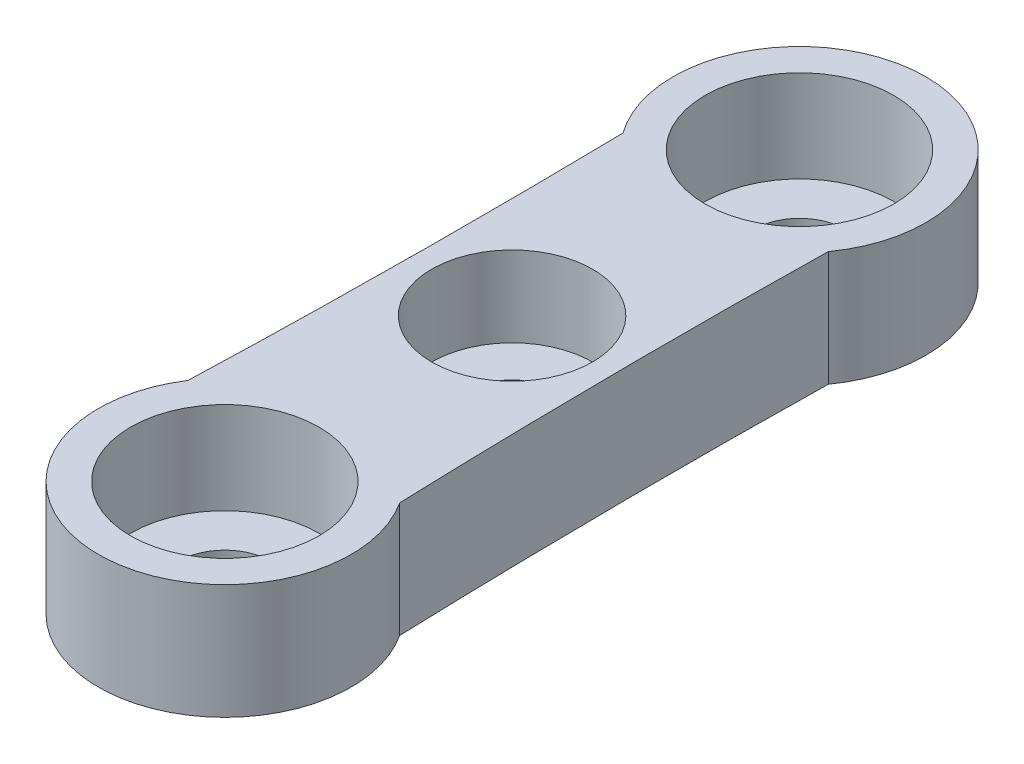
ISO-10303-21;
HEADER;
FILE_DESCRIPTION(('STEP AP214'),'2;1');
FILE_NAME('part.step','',(''),(''),'','','');
FILE_SCHEMA(('AUTOMOTIVE_DESIGN { 1 0 10303 214 1 1 1 1 }'));
ENDSEC;
DATA;
#1=APPLICATION_CONTEXT('core data for automotive mechanical design processes');
#2=APPLICATION_PROTOCOL_DEFINITION('international standard','automotive_design',2000,#1);
#3=PRODUCT_CONTEXT('',#1,'mechanical');
#4=PRODUCT('Part','Part','',(#3));
#5=PRODUCT_RELATED_PRODUCT_CATEGORY('part','',(#4));
#6=PRODUCT_DEFINITION_FORMATION('','',#4);
#7=PRODUCT_DEFINITION_CONTEXT('part definition',#1,'design');
#8=PRODUCT_DEFINITION('design','',#6,#7);
#9=PRODUCT_DEFINITION_SHAPE('','',#8);
#10=(LENGTH_UNIT() NAMED_UNIT(*) SI_UNIT(.MILLI.,.METRE.));
#11=(NAMED_UNIT(*) PLANE_ANGLE_UNIT() SI_UNIT($,.RADIAN.));
#12=(NAMED_UNIT(*) SI_UNIT($,.STERADIAN.) SOLID_ANGLE_UNIT());
#13=UNCERTAINTY_MEASURE_WITH_UNIT(LENGTH_MEASURE(1.E-05),#10,'distance_accuracy_value','');
#14=(GEOMETRIC_REPRESENTATION_CONTEXT(3) GLOBAL_UNCERTAINTY_ASSIGNED_CONTEXT((#13)) GLOBAL_UNIT_ASSIGNED_CONTEXT((#10,
#11,#12)) REPRESENTATION_CONTEXT('',''));
#15=CARTESIAN_POINT('',(0.,0.,0.));
#16=DIRECTION('',(0.,0.,1.));
#17=DIRECTION('',(1.,0.,0.));
#18=AXIS2_PLACEMENT_3D('',#15,#16,#17);
#19=CARTESIAN_POINT('',(0.,10.,0.));
#20=DIRECTION('',(0.,-1.,0.));
#21=DIRECTION('',(0.,0.,-1.));
#22=AXIS2_PLACEMENT_3D('',#19,#20,#21);
#23=CYLINDRICAL_SURFACE('',#22,1.525);
#24=CARTESIAN_POINT('',(0.,0.,0.));
#25=DIRECTION('',(0.,-1.,0.));
#26=DIRECTION('',(0.,0.,-1.));
#27=AXIS2_PLACEMENT_3D('',#24,#25,#26);
#28=CIRCLE('',#27,1.525);
#29=CARTESIAN_POINT('',(0.,0.,-1.525));
#30=VERTEX_POINT('',#29);
#31=EDGE_CURVE('E221',#30,#30,#28,.T.);
#32=ORIENTED_EDGE('',*,*,#31,.T.);
#33=EDGE_LOOP('',(#32));
#34=FACE_BOUND('',#33,.T.);
#35=CARTESIAN_POINT('',(0.,1.5,0.));
#36=DIRECTION('',(0.,1.,0.));
#37=DIRECTION('',(0.,0.,1.));
#38=AXIS2_PLACEMENT_3D('',#35,#36,#37);
#39=CIRCLE('',#38,1.525);
#40=CARTESIAN_POINT('',(0.,1.5,1.525));
#41=VERTEX_POINT('',#40);
#42=EDGE_CURVE('E42',#41,#41,#39,.F.);
#43=ORIENTED_EDGE('',*,*,#42,.F.);
#44=EDGE_LOOP('',(#43));
#45=FACE_BOUND('',#44,.T.);
#46=ADVANCED_FACE('F37',(#34,#45),#23,.F.);
#47=CARTESIAN_POINT('',(4.46618649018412,5.,-9.29014358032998));
#48=CARTESIAN_POINT('',(4.29282361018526,5.,0.105600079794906));
#49=CARTESIAN_POINT('',(4.60828596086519,5.,9.49771745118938));
#50=B_SPLINE_CURVE_WITH_KNOTS('',2,(#47,#48,#49),.UNSPECIFIED.,.F.,.F.,(3,3),(0.,1.),.UNSPECIFIED.);
#51=DIRECTION('',(0.,-1.,0.));
#52=VECTOR('',#51,1.);
#53=SURFACE_OF_LINEAR_EXTRUSION('',#50,#52);
#54=CARTESIAN_POINT('',(4.46618649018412,0.,-9.29014358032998));
#55=CARTESIAN_POINT('',(4.29282361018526,0.,0.105600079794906));
#56=CARTESIAN_POINT('',(4.60828596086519,0.,9.49771745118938));
#57=B_SPLINE_CURVE_WITH_KNOTS('',2,(#54,#55,#56),.UNSPECIFIED.,.F.,.F.,(3,3),(0.,1.),.UNSPECIFIED.);
#58=CARTESIAN_POINT('',(4.46618649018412,0.,-9.29014358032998));
#59=VERTEX_POINT('',#58);
#60=CARTESIAN_POINT('',(4.60828596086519,0.,9.49771745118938));
#61=VERTEX_POINT('',#60);
#62=EDGE_CURVE('E175',#59,#61,#57,.T.);
#63=ORIENTED_EDGE('',*,*,#62,.F.);
#64=DIRECTION('',(0.,-1.,0.));
#65=VECTOR('',#64,1.);
#66=CARTESIAN_POINT('',(4.46618649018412,5.,-9.29014358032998));
#67=LINE('',#66,#65);
#68=CARTESIAN_POINT('',(4.46618649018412,5.,-9.29014358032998));
#69=VERTEX_POINT('',#68);
#70=EDGE_CURVE('E84',#69,#59,#67,.T.);
#71=ORIENTED_EDGE('',*,*,#70,.F.);
#72=CARTESIAN_POINT('',(4.60828596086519,5.,9.49771745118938));
#73=VERTEX_POINT('',#72);
#74=EDGE_CURVE('E93',#69,#73,#50,.T.);
#75=ORIENTED_EDGE('',*,*,#74,.T.);
#76=DIRECTION('',(0.,-1.,0.));
#77=VECTOR('',#76,1.);
#78=CARTESIAN_POINT('',(4.60828596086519,5.,9.49771745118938));
#79=LINE('',#78,#77);
#80=EDGE_CURVE('E80',#73,#61,#79,.T.);
#81=ORIENTED_EDGE('',*,*,#80,.T.);
#82=EDGE_LOOP('',(#63,#71,#75,#81));
#83=FACE_BOUND('',#82,.T.);
#84=ADVANCED_FACE('F39',(#83),#53,.T.);
#85=CARTESIAN_POINT('',(0.,5.,-12.5));
#86=DIRECTION('',(0.,-1.,0.));
#87=DIRECTION('',(0.,0.,-1.));
#88=AXIS2_PLACEMENT_3D('',#85,#86,#87);
#89=CYLINDRICAL_SURFACE('',#88,5.5);
#90=CARTESIAN_POINT('',(0.,0.,-12.5));
#91=DIRECTION('',(0.,1.,0.));
#92=DIRECTION('',(0.,0.,1.));
#93=AXIS2_PLACEMENT_3D('',#90,#91,#92);
#94=CIRCLE('',#93,5.5);
#95=CARTESIAN_POINT('',(-4.46618649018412,0.,-9.29014358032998));
#96=VERTEX_POINT('',#95);
#97=EDGE_CURVE('E99',#59,#96,#94,.T.);
#98=ORIENTED_EDGE('',*,*,#97,.T.);
#99=DIRECTION('',(0.,-1.,0.));
#100=VECTOR('',#99,1.);
#101=CARTESIAN_POINT('',(-4.46618649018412,5.,-9.29014358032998));
#102=LINE('',#101,#100);
#103=CARTESIAN_POINT('',(-4.46618649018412,5.,-9.29014358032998));
#104=VERTEX_POINT('',#103);
#105=EDGE_CURVE('E96',#104,#96,#102,.T.);
#106=ORIENTED_EDGE('',*,*,#105,.F.);
#107=CARTESIAN_POINT('',(0.,5.,-12.5));
#108=DIRECTION('',(0.,1.,0.));
#109=DIRECTION('',(0.,0.,1.));
#110=AXIS2_PLACEMENT_3D('',#107,#108,#109);
#111=CIRCLE('',#110,5.5);
#112=EDGE_CURVE('E87',#69,#104,#111,.T.);
#113=ORIENTED_EDGE('',*,*,#112,.F.);
#114=ORIENTED_EDGE('',*,*,#70,.T.);
#115=EDGE_LOOP('',(#98,#106,#113,#114));
#116=FACE_BOUND('',#115,.T.);
#117=ADVANCED_FACE('F97',(#116),#89,.T.);
#118=CARTESIAN_POINT('',(-4.46618649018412,5.,-9.29014358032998));
#119=CARTESIAN_POINT('',(-4.29282361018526,5.,0.105600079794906));
#120=CARTESIAN_POINT('',(-4.60828596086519,5.,9.49771745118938));
#121=B_SPLINE_CURVE_WITH_KNOTS('',2,(#118,#119,#120),.UNSPECIFIED.,.F.,.F.,(3,3),(0.,1.),.UNSPECIFIED.);
#122=DIRECTION('',(0.,-1.,0.));
#123=VECTOR('',#122,1.);
#124=SURFACE_OF_LINEAR_EXTRUSION('',#121,#123);
#125=CARTESIAN_POINT('',(-4.46618649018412,0.,-9.29014358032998));
#126=CARTESIAN_POINT('',(-4.29282361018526,0.,0.105600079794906));
#127=CARTESIAN_POINT('',(-4.60828596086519,0.,9.49771745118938));
#128=B_SPLINE_CURVE_WITH_KNOTS('',2,(#125,#126,#127),.UNSPECIFIED.,.F.,.F.,(3,3),(0.,1.),.UNSPECIFIED.);
#129=CARTESIAN_POINT('',(-4.60828596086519,0.,9.49771745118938));
#130=VERTEX_POINT('',#129);
#131=EDGE_CURVE('E73',#96,#130,#128,.T.);
#132=ORIENTED_EDGE('',*,*,#131,.T.);
#133=DIRECTION('',(0.,-1.,0.));
#134=VECTOR('',#133,1.);
#135=CARTESIAN_POINT('',(-4.60828596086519,5.,9.49771745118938));
#136=LINE('',#135,#134);
#137=CARTESIAN_POINT('',(-4.60828596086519,5.,9.49771745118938));
#138=VERTEX_POINT('',#137);
#139=EDGE_CURVE('E100',#138,#130,#136,.T.);
#140=ORIENTED_EDGE('',*,*,#139,.F.);
#141=EDGE_CURVE('E92',#104,#138,#121,.T.);
#142=ORIENTED_EDGE('',*,*,#141,.F.);
#143=ORIENTED_EDGE('',*,*,#105,.T.);
#144=EDGE_LOOP('',(#132,#140,#142,#143));
#145=FACE_BOUND('',#144,.T.);
#146=ADVANCED_FACE('F102',(#145),#124,.F.);
#147=CARTESIAN_POINT('',(0.,5.,12.5));
#148=DIRECTION('',(0.,-1.,0.));
#149=DIRECTION('',(0.,0.,-1.));
#150=AXIS2_PLACEMENT_3D('',#147,#148,#149);
#151=CYLINDRICAL_SURFACE('',#150,4.1);
#152=CARTESIAN_POINT('',(0.,1.,12.5));
#153=DIRECTION('',(0.,1.,0.));
#154=DIRECTION('',(0.,0.,1.));
#155=AXIS2_PLACEMENT_3D('',#152,#153,#154);
#156=CIRCLE('',#155,4.1);
#157=CARTESIAN_POINT('',(0.,1.,16.6));
#158=VERTEX_POINT('',#157);
#159=EDGE_CURVE('E11',#158,#158,#156,.T.);
#160=ORIENTED_EDGE('',*,*,#159,.F.);
#161=EDGE_LOOP('',(#160));
#162=FACE_BOUND('',#161,.T.);
#163=CARTESIAN_POINT('',(0.,5.,12.5));
#164=DIRECTION('',(0.,1.,0.));
#165=DIRECTION('',(0.,0.,1.));
#166=AXIS2_PLACEMENT_3D('',#163,#164,#165);
#167=CIRCLE('',#166,4.1);
#168=CARTESIAN_POINT('',(0.,5.,16.6));
#169=VERTEX_POINT('',#168);
#170=EDGE_CURVE('E104',#169,#169,#167,.T.);
#171=ORIENTED_EDGE('',*,*,#170,.T.);
#172=EDGE_LOOP('',(#171));
#173=FACE_BOUND('',#172,.T.);
#174=ADVANCED_FACE('F116',(#162,#173),#151,.F.);
#175=CARTESIAN_POINT('',(0.,5.,12.5));
#176=DIRECTION('',(0.,-1.,0.));
#177=DIRECTION('',(0.,0.,-1.));
#178=AXIS2_PLACEMENT_3D('',#175,#176,#177);
#179=CYLINDRICAL_SURFACE('',#178,5.5);
#180=CARTESIAN_POINT('',(0.,0.,12.5));
#181=DIRECTION('',(0.,1.,0.));
#182=DIRECTION('',(0.,0.,1.));
#183=AXIS2_PLACEMENT_3D('',#180,#181,#182);
#184=CIRCLE('',#183,5.5);
#185=EDGE_CURVE('E188',#130,#61,#184,.T.);
#186=ORIENTED_EDGE('',*,*,#185,.T.);
#187=ORIENTED_EDGE('',*,*,#80,.F.);
#188=CARTESIAN_POINT('',(0.,5.,12.5));
#189=DIRECTION('',(0.,1.,0.));
#190=DIRECTION('',(0.,0.,1.));
#191=AXIS2_PLACEMENT_3D('',#188,#189,#190);
#192=CIRCLE('',#191,5.5);
#193=EDGE_CURVE('E56',#138,#73,#192,.T.);
#194=ORIENTED_EDGE('',*,*,#193,.F.);
#195=ORIENTED_EDGE('',*,*,#139,.T.);
#196=EDGE_LOOP('',(#186,#187,#194,#195));
#197=FACE_BOUND('',#196,.T.);
#198=ADVANCED_FACE('F117',(#197),#179,.T.);
#199=CARTESIAN_POINT('',(0.,5.,-12.5));
#200=DIRECTION('',(0.,-1.,0.));
#201=DIRECTION('',(0.,0.,-1.));
#202=AXIS2_PLACEMENT_3D('',#199,#200,#201);
#203=CYLINDRICAL_SURFACE('',#202,4.1);
#204=CARTESIAN_POINT('',(0.,1.,-12.5));
#205=DIRECTION('',(0.,1.,0.));
#206=DIRECTION('',(0.,0.,1.));
#207=AXIS2_PLACEMENT_3D('',#204,#205,#206);
#208=CIRCLE('',#207,4.1);
#209=CARTESIAN_POINT('',(0.,1.,-8.4));
#210=VERTEX_POINT('',#209);
#211=EDGE_CURVE('E48',#210,#210,#208,.T.);
#212=ORIENTED_EDGE('',*,*,#211,.F.);
#213=EDGE_LOOP('',(#212));
#214=FACE_BOUND('',#213,.T.);
#215=CARTESIAN_POINT('',(0.,5.,-12.5));
#216=DIRECTION('',(0.,1.,0.));
#217=DIRECTION('',(0.,0.,1.));
#218=AXIS2_PLACEMENT_3D('',#215,#216,#217);
#219=CIRCLE('',#218,4.1);
#220=CARTESIAN_POINT('',(0.,5.,-8.4));
#221=VERTEX_POINT('',#220);
#222=EDGE_CURVE('E171',#221,#221,#219,.T.);
#223=ORIENTED_EDGE('',*,*,#222,.T.);
#224=EDGE_LOOP('',(#223));
#225=FACE_BOUND('',#224,.T.);
#226=ADVANCED_FACE('F154',(#214,#225),#203,.F.);
#227=CARTESIAN_POINT('',(0.,5.,0.));
#228=DIRECTION('',(0.,1.,0.));
#229=DIRECTION('',(0.,0.,1.));
#230=AXIS2_PLACEMENT_3D('',#227,#228,#229);
#231=PLANE('',#230);
#232=CARTESIAN_POINT('',(0.,5.,0.));
#233=DIRECTION('',(0.,1.,0.));
#234=DIRECTION('',(0.,0.,1.));
#235=AXIS2_PLACEMENT_3D('',#232,#233,#234);
#236=CIRCLE('',#235,3.5);
#237=CARTESIAN_POINT('',(0.,5.,3.5));
#238=VERTEX_POINT('',#237);
#239=EDGE_CURVE('E225',#238,#238,#236,.T.);
#240=ORIENTED_EDGE('',*,*,#239,.F.);
#241=EDGE_LOOP('',(#240));
#242=FACE_BOUND('',#241,.T.);
#243=ORIENTED_EDGE('',*,*,#74,.F.);
#244=ORIENTED_EDGE('',*,*,#112,.T.);
#245=ORIENTED_EDGE('',*,*,#141,.T.);
#246=ORIENTED_EDGE('',*,*,#193,.T.);
#247=EDGE_LOOP('',(#243,#244,#245,#246));
#248=FACE_BOUND('',#247,.T.);
#249=ORIENTED_EDGE('',*,*,#170,.F.);
#250=EDGE_LOOP('',(#249));
#251=FACE_BOUND('',#250,.T.);
#252=ORIENTED_EDGE('',*,*,#222,.F.);
#253=EDGE_LOOP('',(#252));
#254=FACE_BOUND('',#253,.T.);
#255=ADVANCED_FACE('F89',(#242,#248,#251,#254),#231,.T.);
#256=CARTESIAN_POINT('',(0.,0.,0.));
#257=DIRECTION('',(0.,1.,0.));
#258=DIRECTION('',(0.,0.,1.));
#259=AXIS2_PLACEMENT_3D('',#256,#257,#258);
#260=PLANE('',#259);
#261=ORIENTED_EDGE('',*,*,#31,.F.);
#262=EDGE_LOOP('',(#261));
#263=FACE_BOUND('',#262,.T.);
#264=ORIENTED_EDGE('',*,*,#62,.T.);
#265=ORIENTED_EDGE('',*,*,#185,.F.);
#266=ORIENTED_EDGE('',*,*,#131,.F.);
#267=ORIENTED_EDGE('',*,*,#97,.F.);
#268=EDGE_LOOP('',(#264,#265,#266,#267));
#269=FACE_BOUND('',#268,.T.);
#270=CARTESIAN_POINT('',(0.,0.,-12.5));
#271=DIRECTION('',(0.,1.,0.));
#272=DIRECTION('',(0.,0.,1.));
#273=AXIS2_PLACEMENT_3D('',#270,#271,#272);
#274=CIRCLE('',#273,2.);
#275=CARTESIAN_POINT('',(0.,0.,-10.5));
#276=VERTEX_POINT('',#275);
#277=EDGE_CURVE('E209',#276,#276,#274,.T.);
#278=ORIENTED_EDGE('',*,*,#277,.T.);
#279=EDGE_LOOP('',(#278));
#280=FACE_BOUND('',#279,.T.);
#281=CARTESIAN_POINT('',(0.,0.,12.5));
#282=DIRECTION('',(0.,1.,0.));
#283=DIRECTION('',(0.,0.,1.));
#284=AXIS2_PLACEMENT_3D('',#281,#282,#283);
#285=CIRCLE('',#284,2.);
#286=CARTESIAN_POINT('',(0.,0.,14.5));
#287=VERTEX_POINT('',#286);
#288=EDGE_CURVE('E218',#287,#287,#285,.T.);
#289=ORIENTED_EDGE('',*,*,#288,.T.);
#290=EDGE_LOOP('',(#289));
#291=FACE_BOUND('',#290,.T.);
#292=ADVANCED_FACE('F150',(#263,#269,#280,#291),#260,.F.);
#293=CARTESIAN_POINT('',(0.,1.,-12.5));
#294=DIRECTION('',(0.,-1.,0.));
#295=DIRECTION('',(0.,0.,-1.));
#296=AXIS2_PLACEMENT_3D('',#293,#294,#295);
#297=CYLINDRICAL_SURFACE('',#296,2.);
#298=CARTESIAN_POINT('',(0.,1.,-12.5));
#299=DIRECTION('',(0.,1.,0.));
#300=DIRECTION('',(0.,0.,1.));
#301=AXIS2_PLACEMENT_3D('',#298,#299,#300);
#302=CIRCLE('',#301,2.);
#303=CARTESIAN_POINT('',(0.,1.,-10.5));
#304=VERTEX_POINT('',#303);
#305=EDGE_CURVE('E180',#304,#304,#302,.T.);
#306=ORIENTED_EDGE('',*,*,#305,.T.);
#307=EDGE_LOOP('',(#306));
#308=FACE_BOUND('',#307,.T.);
#309=ORIENTED_EDGE('',*,*,#277,.F.);
#310=EDGE_LOOP('',(#309));
#311=FACE_BOUND('',#310,.T.);
#312=ADVANCED_FACE('F146',(#308,#311),#297,.F.);
#313=CARTESIAN_POINT('',(0.,1.,0.));
#314=DIRECTION('',(0.,1.,0.));
#315=DIRECTION('',(0.,0.,1.));
#316=AXIS2_PLACEMENT_3D('',#313,#314,#315);
#317=PLANE('',#316);
#318=ORIENTED_EDGE('',*,*,#305,.F.);
#319=EDGE_LOOP('',(#318));
#320=FACE_BOUND('',#319,.T.);
#321=ORIENTED_EDGE('',*,*,#211,.T.);
#322=EDGE_LOOP('',(#321));
#323=FACE_BOUND('',#322,.T.);
#324=ADVANCED_FACE('F142',(#320,#323),#317,.T.);
#325=CARTESIAN_POINT('',(0.,1.,12.5));
#326=DIRECTION('',(0.,-1.,0.));
#327=DIRECTION('',(0.,0.,-1.));
#328=AXIS2_PLACEMENT_3D('',#325,#326,#327);
#329=CYLINDRICAL_SURFACE('',#328,2.);
#330=CARTESIAN_POINT('',(0.,1.,12.5));
#331=DIRECTION('',(0.,1.,0.));
#332=DIRECTION('',(0.,0.,1.));
#333=AXIS2_PLACEMENT_3D('',#330,#331,#332);
#334=CIRCLE('',#333,2.);
#335=CARTESIAN_POINT('',(0.,1.,14.5));
#336=VERTEX_POINT('',#335);
#337=EDGE_CURVE('E215',#336,#336,#334,.T.);
#338=ORIENTED_EDGE('',*,*,#337,.T.);
#339=EDGE_LOOP('',(#338));
#340=FACE_BOUND('',#339,.T.);
#341=ORIENTED_EDGE('',*,*,#288,.F.);
#342=EDGE_LOOP('',(#341));
#343=FACE_BOUND('',#342,.T.);
#344=ADVANCED_FACE('F138',(#340,#343),#329,.F.);
#345=CARTESIAN_POINT('',(0.,1.,0.));
#346=DIRECTION('',(0.,1.,0.));
#347=DIRECTION('',(0.,0.,1.));
#348=AXIS2_PLACEMENT_3D('',#345,#346,#347);
#349=PLANE('',#348);
#350=ORIENTED_EDGE('',*,*,#159,.T.);
#351=EDGE_LOOP('',(#350));
#352=FACE_BOUND('',#351,.T.);
#353=ORIENTED_EDGE('',*,*,#337,.F.);
#354=EDGE_LOOP('',(#353));
#355=FACE_BOUND('',#354,.T.);
#356=ADVANCED_FACE('F134',(#352,#355),#349,.T.);
#357=CARTESIAN_POINT('',(0.,1.5,0.));
#358=DIRECTION('',(0.,1.,0.));
#359=DIRECTION('',(0.,0.,1.));
#360=AXIS2_PLACEMENT_3D('',#357,#358,#359);
#361=PLANE('',#360);
#362=CARTESIAN_POINT('',(0.,1.5,0.));
#363=DIRECTION('',(0.,1.,0.));
#364=DIRECTION('',(0.,0.,1.));
#365=AXIS2_PLACEMENT_3D('',#362,#363,#364);
#366=CIRCLE('',#365,3.5);
#367=CARTESIAN_POINT('',(0.,1.5,3.5));
#368=VERTEX_POINT('',#367);
#369=EDGE_CURVE('E228',#368,#368,#366,.T.);
#370=ORIENTED_EDGE('',*,*,#369,.T.);
#371=EDGE_LOOP('',(#370));
#372=FACE_BOUND('',#371,.T.);
#373=ORIENTED_EDGE('',*,*,#42,.T.);
#374=EDGE_LOOP('',(#373));
#375=FACE_BOUND('',#374,.T.);
#376=ADVANCED_FACE('F137',(#372,#375),#361,.T.);
#377=CARTESIAN_POINT('',(0.,1.5,0.));
#378=DIRECTION('',(0.,1.,0.));
#379=DIRECTION('',(0.,0.,1.));
#380=AXIS2_PLACEMENT_3D('',#377,#378,#379);
#381=CYLINDRICAL_SURFACE('',#380,3.5);
#382=ORIENTED_EDGE('',*,*,#369,.F.);
#383=EDGE_LOOP('',(#382));
#384=FACE_BOUND('',#383,.T.);
#385=ORIENTED_EDGE('',*,*,#239,.T.);
#386=EDGE_LOOP('',(#385));
#387=FACE_BOUND('',#386,.T.);
#388=ADVANCED_FACE('F132',(#384,#387),#381,.F.);
#389=CLOSED_SHELL('',(#46,#84,#117,#146,#174,#198,#226,#255,#292,#312,#324,#344,#356,#376,#388));
#390=MANIFOLD_SOLID_BREP('B2',#389);
#391=ADVANCED_BREP_SHAPE_REPRESENTATION('',(#18,#390),#14);
#392=SHAPE_DEFINITION_REPRESENTATION(#9,#391);
ENDSEC;
END-ISO-10303-21;
